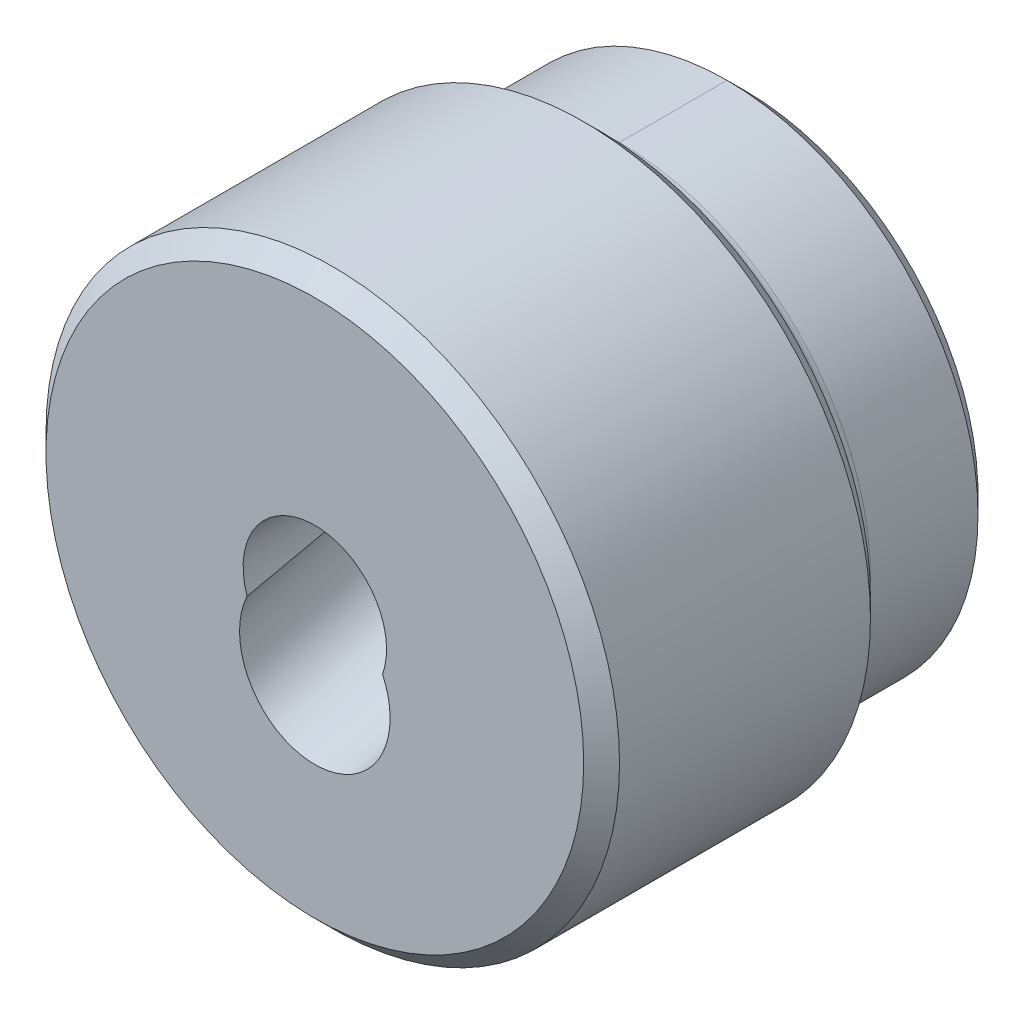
ISO-10303-21;
HEADER;
FILE_DESCRIPTION(('STEP AP214'),'2;1');
FILE_NAME('part.step','',(''),(''),'','','');
FILE_SCHEMA(('AUTOMOTIVE_DESIGN { 1 0 10303 214 1 1 1 1 }'));
ENDSEC;
DATA;
#1=APPLICATION_CONTEXT('core data for automotive mechanical design processes');
#2=APPLICATION_PROTOCOL_DEFINITION('international standard','automotive_design',2000,#1);
#3=PRODUCT_CONTEXT('',#1,'mechanical');
#4=PRODUCT('Part','Part','',(#3));
#5=PRODUCT_RELATED_PRODUCT_CATEGORY('part','',(#4));
#6=PRODUCT_DEFINITION_FORMATION('','',#4);
#7=PRODUCT_DEFINITION_CONTEXT('part definition',#1,'design');
#8=PRODUCT_DEFINITION('design','',#6,#7);
#9=PRODUCT_DEFINITION_SHAPE('','',#8);
#10=(LENGTH_UNIT() NAMED_UNIT(*) SI_UNIT(.MILLI.,.METRE.));
#11=(NAMED_UNIT(*) PLANE_ANGLE_UNIT() SI_UNIT($,.RADIAN.));
#12=(NAMED_UNIT(*) SI_UNIT($,.STERADIAN.) SOLID_ANGLE_UNIT());
#13=UNCERTAINTY_MEASURE_WITH_UNIT(LENGTH_MEASURE(1.E-05),#10,'distance_accuracy_value','');
#14=(GEOMETRIC_REPRESENTATION_CONTEXT(3) GLOBAL_UNCERTAINTY_ASSIGNED_CONTEXT((#13)) GLOBAL_UNIT_ASSIGNED_CONTEXT((#10,
#11,#12)) REPRESENTATION_CONTEXT('',''));
#15=CARTESIAN_POINT('',(0.,0.,0.));
#16=DIRECTION('',(0.,0.,1.));
#17=DIRECTION('',(1.,0.,0.));
#18=AXIS2_PLACEMENT_3D('',#15,#16,#17);
#19=CARTESIAN_POINT('',(9.61400210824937,-9.5,12.));
#20=DIRECTION('',(0.,0.,1.));
#21=DIRECTION('',(0.,1.,0.));
#22=AXIS2_PLACEMENT_3D('',#19,#20,#21);
#23=PLANE('',#22);
#24=CARTESIAN_POINT('',(0.,0.,12.));
#25=DIRECTION('',(0.,0.,1.));
#26=DIRECTION('',(1.,0.,0.));
#27=AXIS2_PLACEMENT_3D('',#24,#25,#26);
#28=CIRCLE('',#27,7.5);
#29=CARTESIAN_POINT('',(7.5,0.,12.));
#30=VERTEX_POINT('',#29);
#31=EDGE_CURVE('E9',#30,#30,#28,.T.);
#32=ORIENTED_EDGE('',*,*,#31,.T.);
#33=EDGE_LOOP('',(#32));
#34=FACE_BOUND('',#33,.T.);
#35=CARTESIAN_POINT('',(0.,-1.60769515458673,12.));
#36=DIRECTION('',(0.,0.,1.));
#37=DIRECTION('',(0.,-1.,0.));
#38=AXIS2_PLACEMENT_3D('',#35,#36,#37);
#39=ELLIPSE('',#38,2.17407997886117,2.1);
#40=CARTESIAN_POINT('',(-1.88882453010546,-0.657527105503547,12.));
#41=VERTEX_POINT('',#40);
#42=CARTESIAN_POINT('',(1.88882453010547,-0.657527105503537,12.));
#43=VERTEX_POINT('',#42);
#44=EDGE_CURVE('E38',#41,#43,#39,.T.);
#45=ORIENTED_EDGE('',*,*,#44,.F.);
#46=CARTESIAN_POINT('',(0.,0.,12.));
#47=DIRECTION('',(0.,0.,-1.));
#48=DIRECTION('',(-1.,0.,0.));
#49=AXIS2_PLACEMENT_3D('',#46,#47,#48);
#50=CIRCLE('',#49,2.);
#51=EDGE_CURVE('E90',#41,#43,#50,.T.);
#52=ORIENTED_EDGE('',*,*,#51,.T.);
#53=EDGE_LOOP('',(#45,#52));
#54=FACE_BOUND('',#53,.T.);
#55=ADVANCED_FACE('F14',(#34,#54),#23,.T.);
#56=CARTESIAN_POINT('',(0.,0.,12.));
#57=DIRECTION('',(0.,0.,-1.));
#58=DIRECTION('',(-1.,0.,0.));
#59=AXIS2_PLACEMENT_3D('',#56,#57,#58);
#60=CYLINDRICAL_SURFACE('',#59,2.);
#61=ORIENTED_EDGE('',*,*,#51,.F.);
#62=CARTESIAN_POINT('',(-1.88882453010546,-0.657527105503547,12.));
#63=CARTESIAN_POINT('',(-1.89726789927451,-0.633254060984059,11.8422956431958));
#64=CARTESIAN_POINT('',(-1.90528806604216,-0.608726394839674,11.6846069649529));
#65=CARTESIAN_POINT('',(-1.9204813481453,-0.558958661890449,11.3692730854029));
#66=CARTESIAN_POINT('',(-1.92765431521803,-0.533718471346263,11.2116278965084));
#67=CARTESIAN_POINT('',(-1.94119581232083,-0.482154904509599,10.8953689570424));
#68=CARTESIAN_POINT('',(-1.94755849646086,-0.455825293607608,10.7367559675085));
#69=CARTESIAN_POINT('',(-1.9593911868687,-0.401930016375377,10.4197299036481));
#70=CARTESIAN_POINT('',(-1.96486132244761,-0.374364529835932,10.2613168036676));
#71=CARTESIAN_POINT('',(-1.97525348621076,-0.315201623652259,9.93183774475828));
#72=CARTESIAN_POINT('',(-1.98009427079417,-0.283458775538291,9.76079498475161));
#73=CARTESIAN_POINT('',(-1.98847796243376,-0.216975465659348,9.41917531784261));
#74=CARTESIAN_POINT('',(-1.99202026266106,-0.182233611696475,9.24859866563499));
#75=CARTESIAN_POINT('',(-1.99742079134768,-0.108214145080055,8.90898488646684));
#76=CARTESIAN_POINT('',(-1.99928482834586,-0.0689527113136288,8.73994446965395));
#77=CARTESIAN_POINT('',(-2.0001095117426,-0.00410339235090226,8.48796766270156));
#78=CARTESIAN_POINT('',(-2.00005624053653,0.0184961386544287,8.40427103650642));
#79=CARTESIAN_POINT('',(-1.99904251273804,0.0664106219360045,8.23767033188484));
#80=CARTESIAN_POINT('',(-1.99808228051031,0.0917249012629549,8.15476606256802));
#81=CARTESIAN_POINT('',(-1.99539979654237,0.136730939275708,8.0185666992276));
#82=CARTESIAN_POINT('',(-1.9940541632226,0.155354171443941,7.96491309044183));
#83=CARTESIAN_POINT('',(-1.99060588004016,0.194623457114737,7.85835067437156));
#84=CARTESIAN_POINT('',(-1.98850301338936,0.215270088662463,7.80544208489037));
#85=CARTESIAN_POINT('',(-1.9832821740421,0.258989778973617,7.70095276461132));
#86=CARTESIAN_POINT('',(-1.98016883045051,0.282051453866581,7.64936711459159));
#87=CARTESIAN_POINT('',(-1.97253065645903,0.331272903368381,7.54781660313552));
#88=CARTESIAN_POINT('',(-1.96800640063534,0.357431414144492,7.49785109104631));
#89=CARTESIAN_POINT('',(-1.95519855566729,0.422668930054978,7.38439251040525));
#90=CARTESIAN_POINT('',(-1.94617120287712,0.463184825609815,7.32177723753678));
#91=CARTESIAN_POINT('',(-1.92286069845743,0.551996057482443,7.20355938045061));
#92=CARTESIAN_POINT('',(-1.908596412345,0.60026312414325,7.14793257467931));
#93=CARTESIAN_POINT('',(-1.87251759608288,0.704794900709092,7.04605695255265));
#94=CARTESIAN_POINT('',(-1.85061504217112,0.761148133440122,6.99992790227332));
#95=CARTESIAN_POINT('',(-1.79803850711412,0.878158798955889,6.91945929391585));
#96=CARTESIAN_POINT('',(-1.76734506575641,0.938825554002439,6.88514626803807));
#97=CARTESIAN_POINT('',(-1.69419501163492,1.06561466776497,6.82441152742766));
#98=CARTESIAN_POINT('',(-1.65092314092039,1.13173202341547,6.79898974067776));
#99=CARTESIAN_POINT('',(-1.55520736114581,1.26007217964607,6.75715767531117));
#100=CARTESIAN_POINT('',(-1.5027462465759,1.32228737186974,6.7407645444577));
#101=CARTESIAN_POINT('',(-1.37443394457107,1.45661997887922,6.71030932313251));
#102=CARTESIAN_POINT('',(-1.29610875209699,1.52679650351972,6.69810881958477));
#103=CARTESIAN_POINT('',(-1.12903704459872,1.65418885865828,6.67928399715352));
#104=CARTESIAN_POINT('',(-1.04028907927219,1.71140288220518,6.67266045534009));
#105=CARTESIAN_POINT('',(-0.854017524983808,1.81160763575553,6.66255796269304));
#106=CARTESIAN_POINT('',(-0.756429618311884,1.85448134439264,6.65910450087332));
#107=CARTESIAN_POINT('',(-0.555655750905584,1.92419990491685,6.65403364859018));
#108=CARTESIAN_POINT('',(-0.452469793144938,1.95104476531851,6.65241625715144));
#109=CARTESIAN_POINT('',(-0.237794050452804,1.98895072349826,6.65023068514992));
#110=CARTESIAN_POINT('',(-0.126148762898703,1.99914033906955,6.64972000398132));
#111=CARTESIAN_POINT('',(0.0972825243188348,2.00075550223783,6.64963609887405));
#112=CARTESIAN_POINT('',(0.209068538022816,1.99217899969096,6.65006297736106));
#113=CARTESIAN_POINT('',(0.430181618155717,1.95641055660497,6.65209250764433));
#114=CARTESIAN_POINT('',(0.539493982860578,1.92912776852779,6.65370090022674));
#115=CARTESIAN_POINT('',(0.751982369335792,1.85664676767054,6.65892346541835));
#116=CARTESIAN_POINT('',(0.8551564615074,1.8114429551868,6.66253826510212));
#117=CARTESIAN_POINT('',(1.0520905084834,1.70457884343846,6.67338766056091));
#118=CARTESIAN_POINT('',(1.14587801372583,1.64296877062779,6.68061126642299));
#119=CARTESIAN_POINT('',(1.27744499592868,1.53988789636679,6.69640555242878));
#120=CARTESIAN_POINT('',(1.31979008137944,1.50374067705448,6.70249871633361));
#121=CARTESIAN_POINT('',(1.40111759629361,1.42826570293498,6.71693940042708));
#122=CARTESIAN_POINT('',(1.44010123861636,1.38893910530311,6.72528610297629));
#123=CARTESIAN_POINT('',(1.52984135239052,1.29060571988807,6.74906807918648));
#124=CARTESIAN_POINT('',(1.57873349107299,1.23022745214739,6.76600785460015));
#125=CARTESIAN_POINT('',(1.66788610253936,1.10632157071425,6.8086382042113));
#126=CARTESIAN_POINT('',(1.70816404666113,1.04280065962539,6.83431078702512));
#127=CARTESIAN_POINT('',(1.7734057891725,0.926669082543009,6.89216911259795));
#128=CARTESIAN_POINT('',(1.79980044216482,0.873990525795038,6.92257686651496));
#129=CARTESIAN_POINT('',(1.84591566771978,0.771838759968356,6.99234259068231));
#130=CARTESIAN_POINT('',(1.86564848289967,0.72235980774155,7.03168391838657));
#131=CARTESIAN_POINT('',(1.89916584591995,0.628999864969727,7.11828491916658));
#132=CARTESIAN_POINT('',(1.91296966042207,0.585101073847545,7.1655182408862));
#133=CARTESIAN_POINT('',(1.93608636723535,0.503369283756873,7.26599870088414));
#134=CARTESIAN_POINT('',(1.94538965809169,0.46554936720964,7.31925840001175));
#135=CARTESIAN_POINT('',(1.96275654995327,0.38678707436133,7.4433843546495));
#136=CARTESIAN_POINT('',(1.96993851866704,0.347401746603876,7.5153383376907));
#137=CARTESIAN_POINT('',(1.98130709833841,0.275220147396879,7.66275855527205));
#138=CARTESIAN_POINT('',(1.98548743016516,0.242437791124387,7.73823180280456));
#139=CARTESIAN_POINT('',(1.99201102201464,0.181243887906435,7.89227993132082));
#140=CARTESIAN_POINT('',(1.99432580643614,0.152905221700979,7.97088434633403));
#141=CARTESIAN_POINT('',(1.99768050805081,0.0998507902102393,8.12922400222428));
#142=CARTESIAN_POINT('',(1.99872164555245,0.0751315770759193,8.20895808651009));
#143=CARTESIAN_POINT('',(2.00054112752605,0.00524326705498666,8.4479380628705));
#144=CARTESIAN_POINT('',(2.00005480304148,-0.0361384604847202,8.60828773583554));
#145=CARTESIAN_POINT('',(1.99715802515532,-0.1131584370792,8.93036120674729));
#146=CARTESIAN_POINT('',(1.99474656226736,-0.148793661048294,9.0920856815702));
#147=CARTESIAN_POINT('',(1.98853695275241,-0.216517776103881,9.41660882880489));
#148=CARTESIAN_POINT('',(1.98473582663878,-0.248598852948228,9.57940906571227));
#149=CARTESIAN_POINT('',(1.97601730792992,-0.310359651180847,9.90538756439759));
#150=CARTESIAN_POINT('',(1.97110017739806,-0.340039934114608,10.0685657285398));
#151=CARTESIAN_POINT('',(1.9608001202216,-0.39492166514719,10.379250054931));
#152=CARTESIAN_POINT('',(1.95550943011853,-0.420277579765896,10.5267321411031));
#153=CARTESIAN_POINT('',(1.94416234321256,-0.46998084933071,10.8218467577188));
#154=CARTESIAN_POINT('',(1.93810589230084,-0.494328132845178,10.9694792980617));
#155=CARTESIAN_POINT('',(1.92527350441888,-0.542156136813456,11.2642347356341));
#156=CARTESIAN_POINT('',(1.91850059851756,-0.565639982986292,11.4113572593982));
#157=CARTESIAN_POINT('',(1.9042163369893,-0.611999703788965,11.7056484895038));
#158=CARTESIAN_POINT('',(1.89670504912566,-0.63487563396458,11.8528171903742));
#159=CARTESIAN_POINT('',(1.88882453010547,-0.657527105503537,12.));
#160=B_SPLINE_CURVE_WITH_KNOTS('',3,(#62,#63,#64,#65,#66,#67,#68,#69,#70,#71,#72,#73,#74,#75,
#76,#77,#78,#79,#80,#81,#82,#83,#84,#85,#86,#87,#88,#89,#90,#91,#92,#93,#94,#95,#96,#97,#98,#99,
#100,#101,#102,#103,#104,#105,#106,#107,#108,#109,#110,#111,#112,#113,#114,#115,#116,#117,#118,
#119,#120,#121,#122,#123,#124,#125,#126,#127,#128,#129,#130,#131,#132,#133,#134,#135,#136,#137,
#138,#139,#140,#141,#142,#143,#144,#145,#146,#147,#148,#149,#150,#151,#152,#153,#154,#155,#156,
#157,#158,#159),.UNSPECIFIED.,.F.,.F.,(4,2,2,2,2,2,2,2,2,2,2,2,2,2,2,2,2,2,2,2,2,2,2,2,2,2,2,2,
2,2,2,2,2,2,2,2,2,2,2,2,2,2,2,2,2,2,2,2,4),(0.,0.479354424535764,0.958792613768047,
1.4415143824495,1.92416615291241,2.44623405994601,2.96854563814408,3.48904244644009,
3.7490922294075,4.00907769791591,4.17947222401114,4.34991557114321,4.51958886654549,
4.6891931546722,4.91388878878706,5.13778279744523,5.36434722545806,5.59141712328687,
5.83911298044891,6.08727766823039,6.4032671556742,6.71930066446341,7.03785353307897,
7.35640623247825,7.69114812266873,8.0259265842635,8.36234253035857,8.69886367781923,
9.03436620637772,9.20219273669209,9.36995845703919,9.60764020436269,9.84483521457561,
10.0428237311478,10.2404463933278,10.4374219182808,10.6348158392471,10.8812308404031,
11.1281598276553,11.3787901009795,11.6291800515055,12.1257362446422,12.6225529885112,
13.1204412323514,13.6182126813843,14.067424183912,14.5166674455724,14.9640808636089,
15.4114532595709),.UNSPECIFIED.);
#161=EDGE_CURVE('E81',#41,#43,#160,.T.);
#162=ORIENTED_EDGE('',*,*,#161,.T.);
#163=EDGE_LOOP('',(#61,#162));
#164=FACE_BOUND('',#163,.T.);
#165=ADVANCED_FACE('F199',(#164),#60,.F.);
#166=CARTESIAN_POINT('',(0.,0.,3.5));
#167=DIRECTION('',(0.,0.,1.));
#168=DIRECTION('',(1.,0.,0.));
#169=AXIS2_PLACEMENT_3D('',#166,#167,#168);
#170=CYLINDRICAL_SURFACE('',#169,7.);
#171=CARTESIAN_POINT('',(0.,0.,3.5));
#172=DIRECTION('',(0.,0.,1.));
#173=DIRECTION('',(1.,0.,0.));
#174=AXIS2_PLACEMENT_3D('',#171,#172,#173);
#175=CIRCLE('',#174,7.);
#176=CARTESIAN_POINT('',(-7.,0.,3.5));
#177=VERTEX_POINT('',#176);
#178=CARTESIAN_POINT('',(0.,-7.,3.5));
#179=VERTEX_POINT('',#178);
#180=EDGE_CURVE('E153',#177,#179,#175,.T.);
#181=ORIENTED_EDGE('',*,*,#180,.F.);
#182=CARTESIAN_POINT('',(0.,0.,3.5));
#183=DIRECTION('',(0.,0.,1.));
#184=DIRECTION('',(1.,0.,0.));
#185=AXIS2_PLACEMENT_3D('',#182,#183,#184);
#186=CIRCLE('',#185,7.);
#187=CARTESIAN_POINT('',(0.,7.,3.5));
#188=VERTEX_POINT('',#187);
#189=EDGE_CURVE('E147',#188,#177,#186,.T.);
#190=ORIENTED_EDGE('',*,*,#189,.F.);
#191=DIRECTION('',(0.,0.,1.));
#192=VECTOR('',#191,1.);
#193=CARTESIAN_POINT('',(0.,7.,2.));
#194=LINE('',#193,#192);
#195=CARTESIAN_POINT('',(0.,7.,0.5));
#196=VERTEX_POINT('',#195);
#197=EDGE_CURVE('E93',#196,#188,#194,.T.);
#198=ORIENTED_EDGE('',*,*,#197,.F.);
#199=CARTESIAN_POINT('',(0.,0.,0.5));
#200=DIRECTION('',(0.,0.,-1.));
#201=DIRECTION('',(0.,1.,0.));
#202=AXIS2_PLACEMENT_3D('',#199,#200,#201);
#203=CIRCLE('',#202,7.);
#204=CARTESIAN_POINT('',(0.,-7.,0.5));
#205=VERTEX_POINT('',#204);
#206=EDGE_CURVE('E105',#205,#196,#203,.T.);
#207=ORIENTED_EDGE('',*,*,#206,.F.);
#208=DIRECTION('',(0.,0.,-1.));
#209=VECTOR('',#208,1.);
#210=CARTESIAN_POINT('',(0.,-7.,2.));
#211=LINE('',#210,#209);
#212=EDGE_CURVE('E150',#179,#205,#211,.T.);
#213=ORIENTED_EDGE('',*,*,#212,.F.);
#214=EDGE_LOOP('',(#181,#190,#198,#207,#213));
#215=FACE_BOUND('',#214,.T.);
#216=ADVANCED_FACE('F205',(#215),#170,.T.);
#217=CARTESIAN_POINT('',(0.,0.,3.5));
#218=DIRECTION('',(0.,0.,1.));
#219=DIRECTION('',(1.,0.,0.));
#220=AXIS2_PLACEMENT_3D('',#217,#218,#219);
#221=CYLINDRICAL_SURFACE('',#220,7.);
#222=ORIENTED_EDGE('',*,*,#212,.T.);
#223=CARTESIAN_POINT('',(0.,0.,0.5));
#224=DIRECTION('',(0.,0.,-1.));
#225=DIRECTION('',(0.,1.,0.));
#226=AXIS2_PLACEMENT_3D('',#223,#224,#225);
#227=CIRCLE('',#226,7.);
#228=EDGE_CURVE('E101',#196,#205,#227,.T.);
#229=ORIENTED_EDGE('',*,*,#228,.F.);
#230=ORIENTED_EDGE('',*,*,#197,.T.);
#231=CARTESIAN_POINT('',(0.,0.,3.5));
#232=DIRECTION('',(0.,0.,1.));
#233=DIRECTION('',(1.,0.,0.));
#234=AXIS2_PLACEMENT_3D('',#231,#232,#233);
#235=CIRCLE('',#234,7.);
#236=CARTESIAN_POINT('',(7.,0.,3.5));
#237=VERTEX_POINT('',#236);
#238=EDGE_CURVE('E156',#237,#188,#235,.T.);
#239=ORIENTED_EDGE('',*,*,#238,.F.);
#240=CARTESIAN_POINT('',(0.,0.,3.5));
#241=DIRECTION('',(0.,0.,1.));
#242=DIRECTION('',(1.,0.,0.));
#243=AXIS2_PLACEMENT_3D('',#240,#241,#242);
#244=CIRCLE('',#243,7.);
#245=EDGE_CURVE('E142',#179,#237,#244,.T.);
#246=ORIENTED_EDGE('',*,*,#245,.F.);
#247=EDGE_LOOP('',(#222,#229,#230,#239,#246));
#248=FACE_BOUND('',#247,.T.);
#249=ADVANCED_FACE('F223',(#248),#221,.T.);
#250=CARTESIAN_POINT('',(0.,0.,3.5));
#251=DIRECTION('',(0.,0.,1.));
#252=DIRECTION('',(1.,0.,0.));
#253=AXIS2_PLACEMENT_3D('',#250,#251,#252);
#254=TOROIDAL_SURFACE('',#253,7.5,0.5);
#255=CARTESIAN_POINT('',(7.5,0.,3.5));
#256=DIRECTION('',(0.,-1.,0.));
#257=DIRECTION('',(-1.,0.,0.));
#258=AXIS2_PLACEMENT_3D('',#255,#256,#257);
#259=CIRCLE('',#258,0.5);
#260=CARTESIAN_POINT('',(7.5,0.,4.));
#261=VERTEX_POINT('',#260);
#262=EDGE_CURVE('E141',#261,#237,#259,.T.);
#263=ORIENTED_EDGE('',*,*,#262,.F.);
#264=CARTESIAN_POINT('',(0.,0.,4.));
#265=DIRECTION('',(0.,0.,-1.));
#266=DIRECTION('',(1.,0.,0.));
#267=AXIS2_PLACEMENT_3D('',#264,#265,#266);
#268=CIRCLE('',#267,7.5);
#269=CARTESIAN_POINT('',(-7.5,0.,4.));
#270=VERTEX_POINT('',#269);
#271=EDGE_CURVE('E231',#270,#261,#268,.F.);
#272=ORIENTED_EDGE('',*,*,#271,.F.);
#273=CARTESIAN_POINT('',(-7.5,0.,3.5));
#274=DIRECTION('',(0.,1.,0.));
#275=DIRECTION('',(1.,0.,0.));
#276=AXIS2_PLACEMENT_3D('',#273,#274,#275);
#277=CIRCLE('',#276,0.5);
#278=EDGE_CURVE('E134',#177,#270,#277,.F.);
#279=ORIENTED_EDGE('',*,*,#278,.F.);
#280=ORIENTED_EDGE('',*,*,#180,.T.);
#281=ORIENTED_EDGE('',*,*,#245,.T.);
#282=EDGE_LOOP('',(#263,#272,#279,#280,#281));
#283=FACE_BOUND('',#282,.T.);
#284=ADVANCED_FACE('F117',(#283),#254,.F.);
#285=CARTESIAN_POINT('',(0.,0.,3.5));
#286=DIRECTION('',(0.,0.,1.));
#287=DIRECTION('',(1.,0.,0.));
#288=AXIS2_PLACEMENT_3D('',#285,#286,#287);
#289=TOROIDAL_SURFACE('',#288,7.5,0.5);
#290=ORIENTED_EDGE('',*,*,#238,.T.);
#291=ORIENTED_EDGE('',*,*,#189,.T.);
#292=ORIENTED_EDGE('',*,*,#278,.T.);
#293=CARTESIAN_POINT('',(0.,0.,4.));
#294=DIRECTION('',(0.,0.,-1.));
#295=DIRECTION('',(-1.,0.,0.));
#296=AXIS2_PLACEMENT_3D('',#293,#294,#295);
#297=CIRCLE('',#296,7.5);
#298=CARTESIAN_POINT('',(0.,7.5,4.));
#299=VERTEX_POINT('',#298);
#300=EDGE_CURVE('E100',#299,#270,#297,.F.);
#301=ORIENTED_EDGE('',*,*,#300,.F.);
#302=CARTESIAN_POINT('',(0.,0.,4.));
#303=DIRECTION('',(0.,0.,-1.));
#304=DIRECTION('',(0.,1.,0.));
#305=AXIS2_PLACEMENT_3D('',#302,#303,#304);
#306=CIRCLE('',#305,7.5);
#307=EDGE_CURVE('E167',#261,#299,#306,.F.);
#308=ORIENTED_EDGE('',*,*,#307,.F.);
#309=ORIENTED_EDGE('',*,*,#262,.T.);
#310=EDGE_LOOP('',(#290,#291,#292,#301,#308,#309));
#311=FACE_BOUND('',#310,.T.);
#312=ADVANCED_FACE('F111',(#311),#289,.F.);
#313=CARTESIAN_POINT('',(0.,0.,0.));
#314=DIRECTION('',(0.,0.,1.));
#315=DIRECTION('',(1.,0.,0.));
#316=AXIS2_PLACEMENT_3D('',#313,#314,#315);
#317=CONICAL_SURFACE('',#316,6.5,0.785398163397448);
#318=DIRECTION('',(0.,0.707106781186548,-0.707106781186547));
#319=VECTOR('',#318,1.);
#320=CARTESIAN_POINT('',(0.,-4.94974746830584,-1.55025253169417));
#321=LINE('',#320,#319);
#322=CARTESIAN_POINT('',(0.,-6.5,0.));
#323=VERTEX_POINT('',#322);
#324=EDGE_CURVE('E97',#205,#323,#321,.T.);
#325=ORIENTED_EDGE('',*,*,#324,.F.);
#326=ORIENTED_EDGE('',*,*,#206,.T.);
#327=DIRECTION('',(0.,0.707106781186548,0.707106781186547));
#328=VECTOR('',#327,1.);
#329=CARTESIAN_POINT('',(0.,4.94974746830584,-1.55025253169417));
#330=LINE('',#329,#328);
#331=CARTESIAN_POINT('',(0.,6.5,0.));
#332=VERTEX_POINT('',#331);
#333=EDGE_CURVE('E102',#332,#196,#330,.T.);
#334=ORIENTED_EDGE('',*,*,#333,.F.);
#335=CARTESIAN_POINT('',(0.,0.,0.));
#336=DIRECTION('',(0.,0.,1.));
#337=DIRECTION('',(1.,0.,0.));
#338=AXIS2_PLACEMENT_3D('',#335,#336,#337);
#339=CIRCLE('',#338,6.5);
#340=EDGE_CURVE('E165',#323,#332,#339,.F.);
#341=ORIENTED_EDGE('',*,*,#340,.F.);
#342=EDGE_LOOP('',(#325,#326,#334,#341));
#343=FACE_BOUND('',#342,.T.);
#344=ADVANCED_FACE('F116',(#343),#317,.T.);
#345=CARTESIAN_POINT('',(0.,0.,0.));
#346=DIRECTION('',(0.,0.,1.));
#347=DIRECTION('',(1.,0.,0.));
#348=AXIS2_PLACEMENT_3D('',#345,#346,#347);
#349=CONICAL_SURFACE('',#348,6.5,0.785398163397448);
#350=ORIENTED_EDGE('',*,*,#324,.T.);
#351=CARTESIAN_POINT('',(0.,0.,0.));
#352=DIRECTION('',(0.,0.,1.));
#353=DIRECTION('',(1.,0.,0.));
#354=AXIS2_PLACEMENT_3D('',#351,#352,#353);
#355=CIRCLE('',#354,6.5);
#356=EDGE_CURVE('E82',#332,#323,#355,.F.);
#357=ORIENTED_EDGE('',*,*,#356,.F.);
#358=ORIENTED_EDGE('',*,*,#333,.T.);
#359=ORIENTED_EDGE('',*,*,#228,.T.);
#360=EDGE_LOOP('',(#350,#357,#358,#359));
#361=FACE_BOUND('',#360,.T.);
#362=ADVANCED_FACE('F210',(#361),#349,.T.);
#363=CARTESIAN_POINT('',(6.57800210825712,6.5,0.));
#364=DIRECTION('',(0.,0.,-1.));
#365=DIRECTION('',(0.,-1.,0.));
#366=AXIS2_PLACEMENT_3D('',#363,#364,#365);
#367=PLANE('',#366);
#368=CARTESIAN_POINT('',(0.,1.60769515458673,0.));
#369=DIRECTION('',(0.,0.,-1.));
#370=DIRECTION('',(0.,-1.,0.));
#371=AXIS2_PLACEMENT_3D('',#368,#369,#370);
#372=ELLIPSE('',#371,2.17407997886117,2.1);
#373=CARTESIAN_POINT('',(-1.88882453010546,0.657527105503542,0.));
#374=VERTEX_POINT('',#373);
#375=CARTESIAN_POINT('',(1.88882453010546,0.657527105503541,0.));
#376=VERTEX_POINT('',#375);
#377=EDGE_CURVE('E31',#374,#376,#372,.T.);
#378=ORIENTED_EDGE('',*,*,#377,.F.);
#379=CARTESIAN_POINT('',(0.,0.,0.));
#380=DIRECTION('',(0.,0.,-1.));
#381=DIRECTION('',(-1.,0.,0.));
#382=AXIS2_PLACEMENT_3D('',#379,#380,#381);
#383=CIRCLE('',#382,2.);
#384=EDGE_CURVE('E87',#376,#374,#383,.T.);
#385=ORIENTED_EDGE('',*,*,#384,.F.);
#386=EDGE_LOOP('',(#378,#385));
#387=FACE_BOUND('',#386,.T.);
#388=ORIENTED_EDGE('',*,*,#340,.T.);
#389=ORIENTED_EDGE('',*,*,#356,.T.);
#390=EDGE_LOOP('',(#388,#389));
#391=FACE_BOUND('',#390,.T.);
#392=ADVANCED_FACE('F85',(#387,#391),#367,.T.);
#393=ORIENTED_EDGE('',*,*,#384,.T.);
#394=CARTESIAN_POINT('',(-1.88882453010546,0.657527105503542,0.));
#395=CARTESIAN_POINT('',(-1.89726789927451,0.633254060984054,0.157704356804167));
#396=CARTESIAN_POINT('',(-1.90528806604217,0.608726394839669,0.315393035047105));
#397=CARTESIAN_POINT('',(-1.9204813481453,0.558958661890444,0.630726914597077));
#398=CARTESIAN_POINT('',(-1.92765431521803,0.533718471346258,0.788372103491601));
#399=CARTESIAN_POINT('',(-1.94119581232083,0.482154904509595,1.10463104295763));
#400=CARTESIAN_POINT('',(-1.94755849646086,0.455825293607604,1.26324403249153));
#401=CARTESIAN_POINT('',(-1.9593911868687,0.401930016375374,1.58027009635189));
#402=CARTESIAN_POINT('',(-1.96486132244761,0.374364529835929,1.73868319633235));
#403=CARTESIAN_POINT('',(-1.97525348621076,0.315201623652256,2.06816225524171));
#404=CARTESIAN_POINT('',(-1.98009427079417,0.283458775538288,2.23920501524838));
#405=CARTESIAN_POINT('',(-1.98847796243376,0.216975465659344,2.58082468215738));
#406=CARTESIAN_POINT('',(-1.99202026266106,0.18223361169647,2.751401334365));
#407=CARTESIAN_POINT('',(-1.99742079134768,0.108214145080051,3.09101511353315));
#408=CARTESIAN_POINT('',(-1.99928482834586,0.0689527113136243,3.26005553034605));
#409=CARTESIAN_POINT('',(-2.0001095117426,0.00410339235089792,3.51203233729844));
#410=CARTESIAN_POINT('',(-2.00005624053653,-0.018496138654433,3.59572896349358));
#411=CARTESIAN_POINT('',(-1.99904251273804,-0.0664106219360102,3.76232966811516));
#412=CARTESIAN_POINT('',(-1.99808228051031,-0.091724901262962,3.84523393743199));
#413=CARTESIAN_POINT('',(-1.99539979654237,-0.136730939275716,3.98143330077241));
#414=CARTESIAN_POINT('',(-1.9940541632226,-0.155354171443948,4.03508690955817));
#415=CARTESIAN_POINT('',(-1.99060588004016,-0.194623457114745,4.14164932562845));
#416=CARTESIAN_POINT('',(-1.98850301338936,-0.215270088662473,4.19455791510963));
#417=CARTESIAN_POINT('',(-1.9832821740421,-0.258989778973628,4.29904723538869));
#418=CARTESIAN_POINT('',(-1.98016883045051,-0.282051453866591,4.35063288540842));
#419=CARTESIAN_POINT('',(-1.97253065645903,-0.33127290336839,4.45218339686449));
#420=CARTESIAN_POINT('',(-1.96800640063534,-0.357431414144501,4.5021489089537));
#421=CARTESIAN_POINT('',(-1.95519855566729,-0.422668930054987,4.61560748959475));
#422=CARTESIAN_POINT('',(-1.94617120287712,-0.463184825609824,4.67822276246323));
#423=CARTESIAN_POINT('',(-1.92286069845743,-0.551996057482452,4.79644061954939));
#424=CARTESIAN_POINT('',(-1.908596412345,-0.60026312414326,4.85206742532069));
#425=CARTESIAN_POINT('',(-1.87251759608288,-0.704794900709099,4.95394304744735));
#426=CARTESIAN_POINT('',(-1.85061504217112,-0.761148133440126,5.00007209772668));
#427=CARTESIAN_POINT('',(-1.79803850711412,-0.878158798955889,5.08054070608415));
#428=CARTESIAN_POINT('',(-1.76734506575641,-0.938825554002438,5.11485373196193));
#429=CARTESIAN_POINT('',(-1.69419501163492,-1.06561466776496,5.17558847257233));
#430=CARTESIAN_POINT('',(-1.65092314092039,-1.13173202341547,5.20101025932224));
#431=CARTESIAN_POINT('',(-1.55520736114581,-1.26007217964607,5.24284232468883));
#432=CARTESIAN_POINT('',(-1.5027462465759,-1.32228737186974,5.25923545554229));
#433=CARTESIAN_POINT('',(-1.37443394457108,-1.45661997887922,5.28969067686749));
#434=CARTESIAN_POINT('',(-1.296108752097,-1.52679650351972,5.30189118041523));
#435=CARTESIAN_POINT('',(-1.12903704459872,-1.65418885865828,5.32071600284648));
#436=CARTESIAN_POINT('',(-1.04028907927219,-1.71140288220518,5.32733954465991));
#437=CARTESIAN_POINT('',(-0.85401752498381,-1.81160763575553,5.33744203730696));
#438=CARTESIAN_POINT('',(-0.756429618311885,-1.85448134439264,5.34089549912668));
#439=CARTESIAN_POINT('',(-0.555655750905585,-1.92419990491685,5.34596635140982));
#440=CARTESIAN_POINT('',(-0.452469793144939,-1.95104476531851,5.34758374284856));
#441=CARTESIAN_POINT('',(-0.237794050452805,-1.98895072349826,5.34976931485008));
#442=CARTESIAN_POINT('',(-0.126148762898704,-1.99914033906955,5.35027999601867));
#443=CARTESIAN_POINT('',(0.0972825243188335,-2.00075550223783,5.35036390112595));
#444=CARTESIAN_POINT('',(0.209068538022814,-1.99217899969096,5.34993702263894));
#445=CARTESIAN_POINT('',(0.430181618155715,-1.95641055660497,5.34790749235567));
#446=CARTESIAN_POINT('',(0.539493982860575,-1.92912776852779,5.34629909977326));
#447=CARTESIAN_POINT('',(0.751982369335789,-1.85664676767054,5.34107653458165));
#448=CARTESIAN_POINT('',(0.855156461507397,-1.8114429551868,5.33746173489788));
#449=CARTESIAN_POINT('',(1.0520905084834,-1.70457884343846,5.32661233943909));
#450=CARTESIAN_POINT('',(1.14587801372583,-1.64296877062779,5.31938873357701));
#451=CARTESIAN_POINT('',(1.27744499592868,-1.53988789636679,5.30359444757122));
#452=CARTESIAN_POINT('',(1.31979008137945,-1.50374067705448,5.29750128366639));
#453=CARTESIAN_POINT('',(1.40111759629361,-1.42826570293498,5.28306059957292));
#454=CARTESIAN_POINT('',(1.44010123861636,-1.38893910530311,5.27471389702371));
#455=CARTESIAN_POINT('',(1.52984135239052,-1.29060571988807,5.25093192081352));
#456=CARTESIAN_POINT('',(1.57873349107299,-1.23022745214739,5.23399214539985));
#457=CARTESIAN_POINT('',(1.66788610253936,-1.10632157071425,5.1913617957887));
#458=CARTESIAN_POINT('',(1.70816404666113,-1.04280065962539,5.16568921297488));
#459=CARTESIAN_POINT('',(1.7734057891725,-0.926669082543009,5.10783088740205));
#460=CARTESIAN_POINT('',(1.79980044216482,-0.87399052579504,5.07742313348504));
#461=CARTESIAN_POINT('',(1.84591566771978,-0.771838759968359,5.00765740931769));
#462=CARTESIAN_POINT('',(1.86564848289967,-0.722359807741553,4.96831608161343));
#463=CARTESIAN_POINT('',(1.89916584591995,-0.628999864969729,4.88171508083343));
#464=CARTESIAN_POINT('',(1.91296966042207,-0.585101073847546,4.83448175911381));
#465=CARTESIAN_POINT('',(1.93608636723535,-0.503369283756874,4.73400129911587));
#466=CARTESIAN_POINT('',(1.94538965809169,-0.465549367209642,4.68074159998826));
#467=CARTESIAN_POINT('',(1.96275654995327,-0.386787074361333,4.55661564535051));
#468=CARTESIAN_POINT('',(1.96993851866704,-0.347401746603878,4.48466166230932));
#469=CARTESIAN_POINT('',(1.98130709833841,-0.275220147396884,4.33724144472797));
#470=CARTESIAN_POINT('',(1.98548743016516,-0.242437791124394,4.26176819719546));
#471=CARTESIAN_POINT('',(1.99201102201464,-0.181243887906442,4.10772006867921));
#472=CARTESIAN_POINT('',(1.99432580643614,-0.152905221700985,4.029115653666));
#473=CARTESIAN_POINT('',(1.99768050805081,-0.0998507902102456,3.87077599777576));
#474=CARTESIAN_POINT('',(1.99872164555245,-0.0751315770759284,3.79104191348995));
#475=CARTESIAN_POINT('',(2.00054112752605,-0.00524326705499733,3.55206193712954));
#476=CARTESIAN_POINT('',(2.00005480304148,0.0361384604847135,3.3917122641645));
#477=CARTESIAN_POINT('',(1.99715802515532,0.113158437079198,3.06963879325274));
#478=CARTESIAN_POINT('',(1.99474656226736,0.148793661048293,2.90791431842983));
#479=CARTESIAN_POINT('',(1.98853695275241,0.21651777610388,2.58339117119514));
#480=CARTESIAN_POINT('',(1.98473582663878,0.248598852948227,2.42059093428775));
#481=CARTESIAN_POINT('',(1.97601730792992,0.310359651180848,2.09461243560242));
#482=CARTESIAN_POINT('',(1.97110017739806,0.340039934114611,1.93143427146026));
#483=CARTESIAN_POINT('',(1.9608001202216,0.394921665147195,1.62074994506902));
#484=CARTESIAN_POINT('',(1.95550943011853,0.4202775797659,1.47326785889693));
#485=CARTESIAN_POINT('',(1.94416234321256,0.469980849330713,1.17815324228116));
#486=CARTESIAN_POINT('',(1.93810589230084,0.494328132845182,1.03052070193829));
#487=CARTESIAN_POINT('',(1.92527350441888,0.54215613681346,0.735765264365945));
#488=CARTESIAN_POINT('',(1.91850059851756,0.565639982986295,0.588642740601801));
#489=CARTESIAN_POINT('',(1.9042163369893,0.611999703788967,0.294351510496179));
#490=CARTESIAN_POINT('',(1.89670504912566,0.634875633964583,0.147182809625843));
#491=CARTESIAN_POINT('',(1.88882453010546,0.657527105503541,0.));
#492=B_SPLINE_CURVE_WITH_KNOTS('',3,(#394,#395,#396,#397,#398,#399,#400,#401,#402,#403,#404,
#405,#406,#407,#408,#409,#410,#411,#412,#413,#414,#415,#416,#417,#418,#419,#420,#421,#422,#423,
#424,#425,#426,#427,#428,#429,#430,#431,#432,#433,#434,#435,#436,#437,#438,#439,#440,#441,#442,
#443,#444,#445,#446,#447,#448,#449,#450,#451,#452,#453,#454,#455,#456,#457,#458,#459,#460,#461,
#462,#463,#464,#465,#466,#467,#468,#469,#470,#471,#472,#473,#474,#475,#476,#477,#478,#479,#480,
#481,#482,#483,#484,#485,#486,#487,#488,#489,#490,#491),.UNSPECIFIED.,.F.,.F.,(4,2,2,2,2,2,2,2,
2,2,2,2,2,2,2,2,2,2,2,2,2,2,2,2,2,2,2,2,2,2,2,2,2,2,2,2,2,2,2,2,2,2,2,2,2,2,2,2,4),(0.,
0.47935442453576,0.958792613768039,1.44151438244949,1.92416615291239,2.446234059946,
2.96854563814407,3.48904244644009,3.7490922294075,4.00907769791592,4.17947222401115,
4.34991557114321,4.5195888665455,4.68919315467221,4.91388878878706,5.13778279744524,
5.36434722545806,5.59141712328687,5.8391129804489,6.08727766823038,6.4032671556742,
6.71930066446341,7.03785353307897,7.35640623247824,7.69114812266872,8.0259265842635,
8.36234253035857,8.69886367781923,9.03436620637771,9.20219273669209,9.36995845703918,
9.60764020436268,9.84483521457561,10.0428237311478,10.2404463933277,10.4374219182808,
10.634815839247,10.881230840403,11.1281598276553,11.3787901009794,11.6291800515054,
12.1257362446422,12.6225529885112,13.1204412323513,13.6182126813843,14.067424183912,
14.5166674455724,14.9640808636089,15.4114532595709),.UNSPECIFIED.);
#493=EDGE_CURVE('E76',#374,#376,#492,.T.);
#494=ORIENTED_EDGE('',*,*,#493,.T.);
#495=EDGE_LOOP('',(#393,#494));
#496=FACE_BOUND('',#495,.T.);
#497=ADVANCED_FACE('F89',(#496),#60,.F.);
#498=CARTESIAN_POINT('',(0.,2.5881904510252,-3.65925826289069));
#499=DIRECTION('',(0.,-0.25881904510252,0.965925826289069));
#500=DIRECTION('',(0.,-0.965925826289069,-0.25881904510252));
#501=AXIS2_PLACEMENT_3D('',#498,#499,#500);
#502=CYLINDRICAL_SURFACE('',#501,2.1);
#503=ORIENTED_EDGE('',*,*,#44,.T.);
#504=ORIENTED_EDGE('',*,*,#161,.F.);
#505=EDGE_LOOP('',(#503,#504));
#506=FACE_BOUND('',#505,.T.);
#507=ORIENTED_EDGE('',*,*,#377,.T.);
#508=ORIENTED_EDGE('',*,*,#493,.F.);
#509=EDGE_LOOP('',(#507,#508));
#510=FACE_BOUND('',#509,.T.);
#511=ADVANCED_FACE('F77',(#506,#510),#502,.F.);
#512=CARTESIAN_POINT('',(0.,0.,-8.));
#513=DIRECTION('',(0.,0.,1.));
#514=DIRECTION('',(1.,0.,0.));
#515=AXIS2_PLACEMENT_3D('',#512,#513,#514);
#516=CYLINDRICAL_SURFACE('',#515,8.);
#517=CARTESIAN_POINT('',(0.,0.,4.5));
#518=DIRECTION('',(0.,0.,-1.));
#519=DIRECTION('',(-1.,0.,0.));
#520=AXIS2_PLACEMENT_3D('',#517,#518,#519);
#521=CIRCLE('',#520,8.);
#522=CARTESIAN_POINT('',(-8.,0.,4.5));
#523=VERTEX_POINT('',#522);
#524=EDGE_CURVE('E24',#523,#523,#521,.F.);
#525=ORIENTED_EDGE('',*,*,#524,.T.);
#526=EDGE_LOOP('',(#525));
#527=FACE_BOUND('',#526,.T.);
#528=CARTESIAN_POINT('',(0.,0.,11.5));
#529=DIRECTION('',(0.,0.,1.));
#530=DIRECTION('',(1.,0.,0.));
#531=AXIS2_PLACEMENT_3D('',#528,#529,#530);
#532=CIRCLE('',#531,8.);
#533=CARTESIAN_POINT('',(8.,0.,11.5));
#534=VERTEX_POINT('',#533);
#535=EDGE_CURVE('E351',#534,#534,#532,.F.);
#536=ORIENTED_EDGE('',*,*,#535,.T.);
#537=EDGE_LOOP('',(#536));
#538=FACE_BOUND('',#537,.T.);
#539=ADVANCED_FACE('F185',(#527,#538),#516,.T.);
#540=CARTESIAN_POINT('',(0.,0.,4.));
#541=DIRECTION('',(0.,0.,1.));
#542=DIRECTION('',(1.,0.,0.));
#543=AXIS2_PLACEMENT_3D('',#540,#541,#542);
#544=CONICAL_SURFACE('',#543,7.5,0.785398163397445);
#545=ORIENTED_EDGE('',*,*,#524,.F.);
#546=EDGE_LOOP('',(#545));
#547=FACE_BOUND('',#546,.T.);
#548=ORIENTED_EDGE('',*,*,#307,.T.);
#549=ORIENTED_EDGE('',*,*,#300,.T.);
#550=ORIENTED_EDGE('',*,*,#271,.T.);
#551=EDGE_LOOP('',(#548,#549,#550));
#552=FACE_BOUND('',#551,.T.);
#553=ADVANCED_FACE('F188',(#547,#552),#544,.T.);
#554=CARTESIAN_POINT('',(0.,0.,12.));
#555=DIRECTION('',(0.,0.,-1.));
#556=DIRECTION('',(-1.,0.,0.));
#557=AXIS2_PLACEMENT_3D('',#554,#555,#556);
#558=CONICAL_SURFACE('',#557,7.5,0.785398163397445);
#559=ORIENTED_EDGE('',*,*,#535,.F.);
#560=EDGE_LOOP('',(#559));
#561=FACE_BOUND('',#560,.T.);
#562=ORIENTED_EDGE('',*,*,#31,.F.);
#563=EDGE_LOOP('',(#562));
#564=FACE_BOUND('',#563,.T.);
#565=ADVANCED_FACE('F16',(#561,#564),#558,.T.);
#566=CLOSED_SHELL('',(#55,#165,#216,#249,#284,#312,#344,#362,#392,#497,#511,#539,#553,#565));
#567=MANIFOLD_SOLID_BREP('B1',#566);
#568=ADVANCED_BREP_SHAPE_REPRESENTATION('',(#18,#567),#14);
#569=SHAPE_DEFINITION_REPRESENTATION(#9,#568);
ENDSEC;
END-ISO-10303-21;
